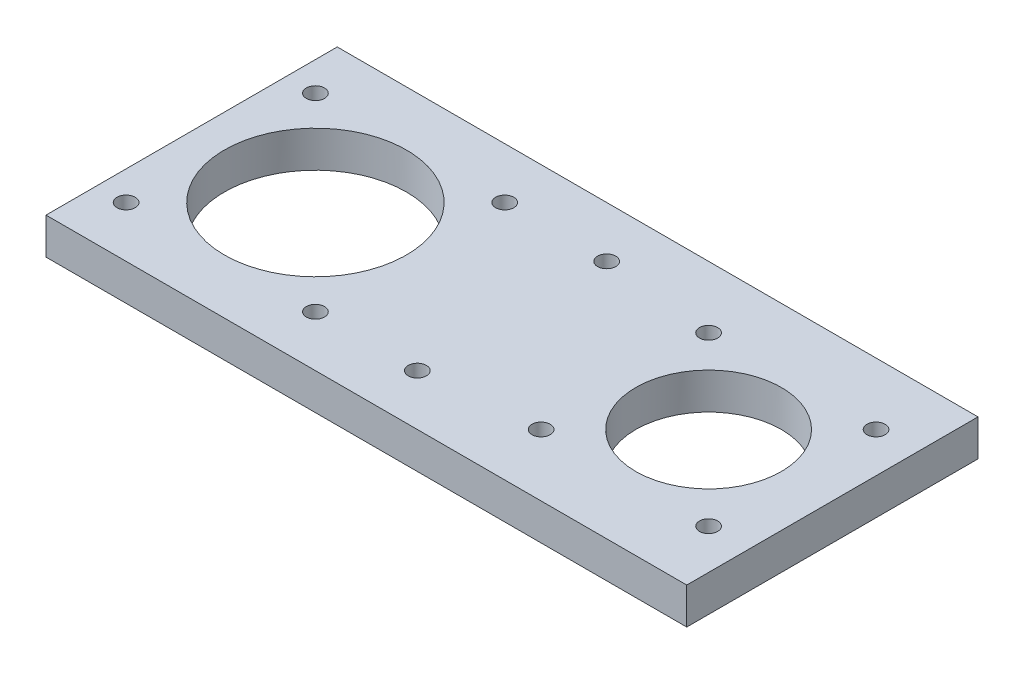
from build123d import *

# Parameters (mm, degrees)
SKETCH_1_W               = 88
SKETCH_1_H               = 40
EXTRUDE_1_DEPTH          = 5
SKETCH_2_R               = 1.25
CUT_EXTRUDE_1_DEPTH      = 5
SKETCH_3_R               = 12.5
CUT_EXTRUDE_2_DEPTH      = 10
SKETCH_4_R               = 1.25
CUT_EXTRUDE_3_DEPTH      = 10
PATTERN_CIRCULAR_1_COUNT = 4
SKETCH_5_R               = 10
CUT_EXTRUDE_4_DEPTH      = 10
SKETCH_6_R               = 1.25
CUT_EXTRUDE_5_DEPTH      = 10
PATTERN_CIRCULAR_2_COUNT = 4


with BuildPart() as part:
    # Sketch 1 → Extrude 1 (new body)
    with BuildSketch(Plane(origin=(0, 0, 0), x_dir=(1, 0, 0), z_dir=(0, 1, 0))):
        with Locations((44, 20)):
            Rectangle(SKETCH_1_W, SKETCH_1_H)
    extrude(amount=EXTRUDE_1_DEPTH)

    # Sketch 2 → Cut-Extrude 1 (cut)
    with BuildSketch(Plane(origin=(0, 5, 0), x_dir=(1, 0, 0), z_dir=(0, 1, 0))):
        with Locations(Location((44, 33, 0), (0, 0, 270))):
            Circle(SKETCH_2_R)
        with Locations(Location((44, 7, 0), (0, 0, 270))):
            Circle(SKETCH_2_R)
    extrude(amount=-CUT_EXTRUDE_1_DEPTH, mode=Mode.SUBTRACT)

    # Sketch 3 → Cut-Extrude 2 (cut)
    with BuildSketch(Plane(origin=(0, 5, 0), x_dir=(1, 0, 0), z_dir=(0, 1, 0))):
        with Locations(Location((17, 20, 0), (0, 0, 270))):
            Circle(SKETCH_3_R)
    extrude(amount=-CUT_EXTRUDE_2_DEPTH, mode=Mode.SUBTRACT)

    # Sketch 4 → Cut-Extrude 3 (cut)
    with BuildSketch(Plane(origin=(0, 5, 0), x_dir=(1, 0, 0), z_dir=(0, 1, 0))):
        with Locations(Location((4, 33, 0), (0, 0, 270))):
            Circle(SKETCH_4_R)
    cut_extrude_3 = extrude(amount=-CUT_EXTRUDE_3_DEPTH, mode=Mode.SUBTRACT)

    # Pattern Circular 1: Cut-Extrude 3 ×4 about axis
    pattern_circular_1_axis = Axis((17, 0, -20), (0, 1, 0))
    for i in range(1, PATTERN_CIRCULAR_1_COUNT):
        add(cut_extrude_3.rotate(pattern_circular_1_axis, i * 360 / PATTERN_CIRCULAR_1_COUNT), mode=Mode.SUBTRACT)

    # Sketch 5 → Cut-Extrude 4 (cut)
    with BuildSketch(Plane(origin=(0, 5, 0), x_dir=(1, 0, 0), z_dir=(0, 1, 0))):
        with Locations(Location((71, 20, 0), (0, 0, 270))):
            Circle(SKETCH_5_R)
    extrude(amount=-CUT_EXTRUDE_4_DEPTH, mode=Mode.SUBTRACT)

    # Sketch 6 → Cut-Extrude 5 (cut)
    with BuildSketch(Plane(origin=(0, 5, 0), x_dir=(1, 0, 0), z_dir=(0, 1, 0))):
        with Locations(Location((59.5, 31.5, 0), (0, 0, 270))):
            Circle(SKETCH_6_R)
    cut_extrude_5 = extrude(amount=-CUT_EXTRUDE_5_DEPTH, mode=Mode.SUBTRACT)

    # Pattern Circular 2: Cut-Extrude 5 ×4 about axis
    pattern_circular_2_axis = Axis((71, 0, -20), (0, 1, 0))
    for i in range(1, PATTERN_CIRCULAR_2_COUNT):
        add(cut_extrude_5.rotate(pattern_circular_2_axis, i * 360 / PATTERN_CIRCULAR_2_COUNT), mode=Mode.SUBTRACT)


solid = part.part
